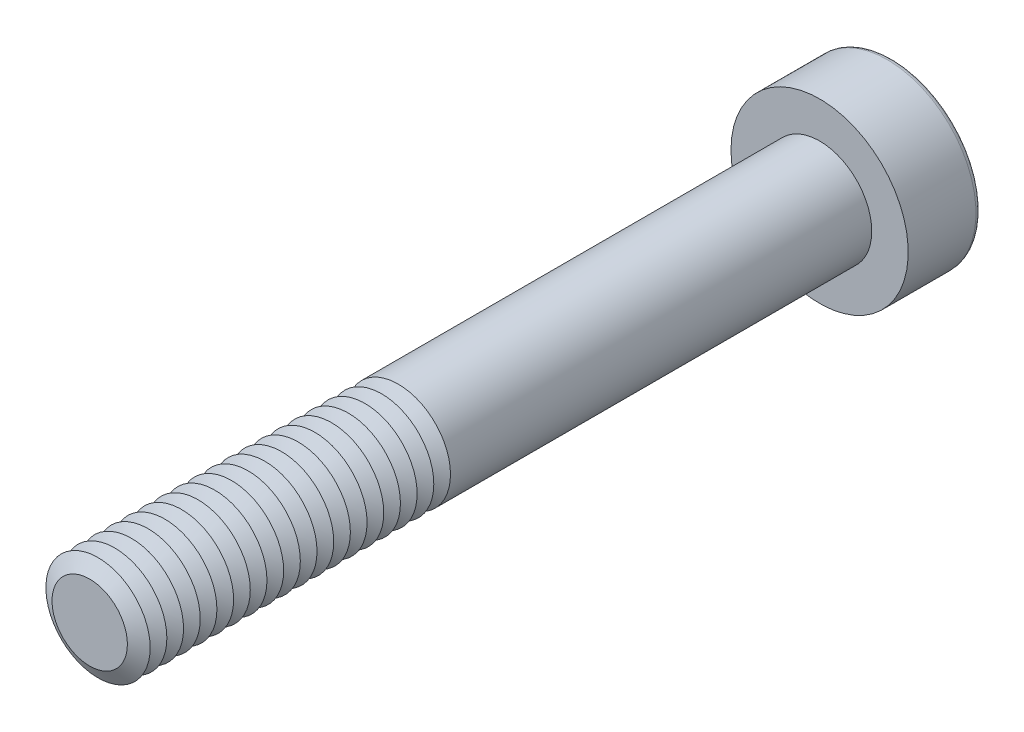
ISO-10303-21;
HEADER;
FILE_DESCRIPTION(('STEP AP214'),'2;1');
FILE_NAME('part.step','',(''),(''),'','','');
FILE_SCHEMA(('AUTOMOTIVE_DESIGN { 1 0 10303 214 1 1 1 1 }'));
ENDSEC;
DATA;
#1=APPLICATION_CONTEXT('core data for automotive mechanical design processes');
#2=APPLICATION_PROTOCOL_DEFINITION('international standard','automotive_design',2000,#1);
#3=PRODUCT_CONTEXT('',#1,'mechanical');
#4=PRODUCT('Part','Part','',(#3));
#5=PRODUCT_RELATED_PRODUCT_CATEGORY('part','',(#4));
#6=PRODUCT_DEFINITION_FORMATION('','',#4);
#7=PRODUCT_DEFINITION_CONTEXT('part definition',#1,'design');
#8=PRODUCT_DEFINITION('design','',#6,#7);
#9=PRODUCT_DEFINITION_SHAPE('','',#8);
#10=(LENGTH_UNIT() NAMED_UNIT(*) SI_UNIT(.MILLI.,.METRE.));
#11=(NAMED_UNIT(*) PLANE_ANGLE_UNIT() SI_UNIT($,.RADIAN.));
#12=(NAMED_UNIT(*) SI_UNIT($,.STERADIAN.) SOLID_ANGLE_UNIT());
#13=UNCERTAINTY_MEASURE_WITH_UNIT(LENGTH_MEASURE(1.E-05),#10,'distance_accuracy_value','');
#14=(GEOMETRIC_REPRESENTATION_CONTEXT(3) GLOBAL_UNCERTAINTY_ASSIGNED_CONTEXT((#13)) GLOBAL_UNIT_ASSIGNED_CONTEXT((#10,
#11,#12)) REPRESENTATION_CONTEXT('',''));
#15=CARTESIAN_POINT('',(0.,0.,0.));
#16=DIRECTION('',(0.,0.,1.));
#17=DIRECTION('',(1.,0.,0.));
#18=AXIS2_PLACEMENT_3D('',#15,#16,#17);
#19=CARTESIAN_POINT('',(0.,0.,32.2));
#20=DIRECTION('',(0.,0.,1.));
#21=DIRECTION('',(1.,0.,0.));
#22=AXIS2_PLACEMENT_3D('',#19,#20,#21);
#23=CONICAL_SURFACE('',#22,2.5,1.0471975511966);
#24=CARTESIAN_POINT('',(0.,0.,31.8));
#25=DIRECTION('',(0.,0.,1.));
#26=DIRECTION('',(1.,0.,0.));
#27=AXIS2_PLACEMENT_3D('',#24,#25,#26);
#28=CIRCLE('',#27,1.80717967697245);
#29=CARTESIAN_POINT('',(1.80717967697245,0.,31.8));
#30=VERTEX_POINT('',#29);
#31=EDGE_CURVE('E314',#30,#30,#28,.T.);
#32=ORIENTED_EDGE('',*,*,#31,.T.);
#33=EDGE_LOOP('',(#32));
#34=FACE_BOUND('',#33,.T.);
#35=CARTESIAN_POINT('',(0.,0.,32.2));
#36=DIRECTION('',(0.,0.,1.));
#37=DIRECTION('',(1.,0.,0.));
#38=AXIS2_PLACEMENT_3D('',#35,#36,#37);
#39=CIRCLE('',#38,2.5);
#40=CARTESIAN_POINT('',(2.5,0.,32.2));
#41=VERTEX_POINT('',#40);
#42=EDGE_CURVE('E317',#41,#41,#39,.T.);
#43=ORIENTED_EDGE('',*,*,#42,.F.);
#44=EDGE_LOOP('',(#43));
#45=FACE_BOUND('',#44,.T.);
#46=ADVANCED_FACE('F39',(#34,#45),#23,.T.);
#47=CARTESIAN_POINT('',(0.,0.,31.8));
#48=DIRECTION('',(0.,0.,-1.));
#49=DIRECTION('',(-1.,0.,0.));
#50=AXIS2_PLACEMENT_3D('',#47,#48,#49);
#51=CONICAL_SURFACE('',#50,1.80717967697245,1.04719755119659);
#52=CARTESIAN_POINT('',(0.,0.,31.4));
#53=DIRECTION('',(0.,0.,1.));
#54=DIRECTION('',(1.,0.,0.));
#55=AXIS2_PLACEMENT_3D('',#52,#53,#54);
#56=CIRCLE('',#55,2.5);
#57=CARTESIAN_POINT('',(2.5,0.,31.4));
#58=VERTEX_POINT('',#57);
#59=EDGE_CURVE('E324',#58,#58,#56,.T.);
#60=ORIENTED_EDGE('',*,*,#59,.T.);
#61=EDGE_LOOP('',(#60));
#62=FACE_BOUND('',#61,.T.);
#63=ORIENTED_EDGE('',*,*,#31,.F.);
#64=EDGE_LOOP('',(#63));
#65=FACE_BOUND('',#64,.T.);
#66=ADVANCED_FACE('F245',(#62,#65),#51,.T.);
#67=CARTESIAN_POINT('',(0.,0.,35.));
#68=DIRECTION('',(0.,0.,1.));
#69=DIRECTION('',(1.,0.,0.));
#70=AXIS2_PLACEMENT_3D('',#67,#68,#69);
#71=PLANE('',#70);
#72=CARTESIAN_POINT('',(0.,0.,35.));
#73=DIRECTION('',(0.,0.,1.));
#74=DIRECTION('',(1.,0.,0.));
#75=AXIS2_PLACEMENT_3D('',#72,#73,#74);
#76=CIRCLE('',#75,1.80717967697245);
#77=CARTESIAN_POINT('',(1.80717967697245,0.,35.));
#78=VERTEX_POINT('',#77);
#79=EDGE_CURVE('E174',#78,#78,#76,.T.);
#80=ORIENTED_EDGE('',*,*,#79,.T.);
#81=EDGE_LOOP('',(#80));
#82=FACE_BOUND('',#81,.T.);
#83=ADVANCED_FACE('F251',(#82),#71,.T.);
#84=CARTESIAN_POINT('',(0.,0.,35.));
#85=DIRECTION('',(0.,0.,-1.));
#86=DIRECTION('',(-1.,0.,0.));
#87=AXIS2_PLACEMENT_3D('',#84,#85,#86);
#88=CONICAL_SURFACE('',#87,1.80717967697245,1.04719755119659);
#89=CARTESIAN_POINT('',(0.,0.,34.6));
#90=DIRECTION('',(0.,0.,1.));
#91=DIRECTION('',(1.,0.,0.));
#92=AXIS2_PLACEMENT_3D('',#89,#90,#91);
#93=CIRCLE('',#92,2.5);
#94=CARTESIAN_POINT('',(2.5,0.,34.6));
#95=VERTEX_POINT('',#94);
#96=EDGE_CURVE('E291',#95,#95,#93,.T.);
#97=ORIENTED_EDGE('',*,*,#96,.T.);
#98=EDGE_LOOP('',(#97));
#99=FACE_BOUND('',#98,.T.);
#100=ORIENTED_EDGE('',*,*,#79,.F.);
#101=EDGE_LOOP('',(#100));
#102=FACE_BOUND('',#101,.T.);
#103=ADVANCED_FACE('F199',(#99,#102),#88,.T.);
#104=CARTESIAN_POINT('',(0.,0.,34.6));
#105=DIRECTION('',(0.,0.,1.));
#106=DIRECTION('',(1.,0.,0.));
#107=AXIS2_PLACEMENT_3D('',#104,#105,#106);
#108=CONICAL_SURFACE('',#107,2.5,1.0471975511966);
#109=CARTESIAN_POINT('',(0.,0.,34.2));
#110=DIRECTION('',(0.,0.,1.));
#111=DIRECTION('',(1.,0.,0.));
#112=AXIS2_PLACEMENT_3D('',#109,#110,#111);
#113=CIRCLE('',#112,1.80717967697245);
#114=CARTESIAN_POINT('',(1.80717967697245,0.,34.2));
#115=VERTEX_POINT('',#114);
#116=EDGE_CURVE('E288',#115,#115,#113,.T.);
#117=ORIENTED_EDGE('',*,*,#116,.T.);
#118=EDGE_LOOP('',(#117));
#119=FACE_BOUND('',#118,.T.);
#120=ORIENTED_EDGE('',*,*,#96,.F.);
#121=EDGE_LOOP('',(#120));
#122=FACE_BOUND('',#121,.T.);
#123=ADVANCED_FACE('F277',(#119,#122),#108,.T.);
#124=CARTESIAN_POINT('',(0.,0.,34.2));
#125=DIRECTION('',(0.,0.,-1.));
#126=DIRECTION('',(-1.,0.,0.));
#127=AXIS2_PLACEMENT_3D('',#124,#125,#126);
#128=CONICAL_SURFACE('',#127,1.80717967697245,1.04719755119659);
#129=CARTESIAN_POINT('',(0.,0.,33.8));
#130=DIRECTION('',(0.,0.,1.));
#131=DIRECTION('',(1.,0.,0.));
#132=AXIS2_PLACEMENT_3D('',#129,#130,#131);
#133=CIRCLE('',#132,2.5);
#134=CARTESIAN_POINT('',(2.5,0.,33.8));
#135=VERTEX_POINT('',#134);
#136=EDGE_CURVE('E300',#135,#135,#133,.T.);
#137=ORIENTED_EDGE('',*,*,#136,.T.);
#138=EDGE_LOOP('',(#137));
#139=FACE_BOUND('',#138,.T.);
#140=ORIENTED_EDGE('',*,*,#116,.F.);
#141=EDGE_LOOP('',(#140));
#142=FACE_BOUND('',#141,.T.);
#143=ADVANCED_FACE('F274',(#139,#142),#128,.T.);
#144=CARTESIAN_POINT('',(0.,0.,33.8));
#145=DIRECTION('',(0.,0.,1.));
#146=DIRECTION('',(1.,0.,0.));
#147=AXIS2_PLACEMENT_3D('',#144,#145,#146);
#148=CONICAL_SURFACE('',#147,2.5,1.0471975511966);
#149=CARTESIAN_POINT('',(0.,0.,33.4));
#150=DIRECTION('',(0.,0.,1.));
#151=DIRECTION('',(1.,0.,0.));
#152=AXIS2_PLACEMENT_3D('',#149,#150,#151);
#153=CIRCLE('',#152,1.80717967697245);
#154=CARTESIAN_POINT('',(1.80717967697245,0.,33.4));
#155=VERTEX_POINT('',#154);
#156=EDGE_CURVE('E293',#155,#155,#153,.T.);
#157=ORIENTED_EDGE('',*,*,#156,.T.);
#158=EDGE_LOOP('',(#157));
#159=FACE_BOUND('',#158,.T.);
#160=ORIENTED_EDGE('',*,*,#136,.F.);
#161=EDGE_LOOP('',(#160));
#162=FACE_BOUND('',#161,.T.);
#163=ADVANCED_FACE('F270',(#159,#162),#148,.T.);
#164=CARTESIAN_POINT('',(0.,0.,33.4));
#165=DIRECTION('',(0.,0.,-1.));
#166=DIRECTION('',(-1.,0.,0.));
#167=AXIS2_PLACEMENT_3D('',#164,#165,#166);
#168=CONICAL_SURFACE('',#167,1.80717967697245,1.04719755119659);
#169=CARTESIAN_POINT('',(0.,0.,33.));
#170=DIRECTION('',(0.,0.,1.));
#171=DIRECTION('',(1.,0.,0.));
#172=AXIS2_PLACEMENT_3D('',#169,#170,#171);
#173=CIRCLE('',#172,2.5);
#174=CARTESIAN_POINT('',(2.5,0.,33.));
#175=VERTEX_POINT('',#174);
#176=EDGE_CURVE('E310',#175,#175,#173,.T.);
#177=ORIENTED_EDGE('',*,*,#176,.T.);
#178=EDGE_LOOP('',(#177));
#179=FACE_BOUND('',#178,.T.);
#180=ORIENTED_EDGE('',*,*,#156,.F.);
#181=EDGE_LOOP('',(#180));
#182=FACE_BOUND('',#181,.T.);
#183=ADVANCED_FACE('F266',(#179,#182),#168,.T.);
#184=CARTESIAN_POINT('',(0.,0.,33.));
#185=DIRECTION('',(0.,0.,1.));
#186=DIRECTION('',(1.,0.,0.));
#187=AXIS2_PLACEMENT_3D('',#184,#185,#186);
#188=CONICAL_SURFACE('',#187,2.5,1.0471975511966);
#189=CARTESIAN_POINT('',(0.,0.,32.6));
#190=DIRECTION('',(0.,0.,1.));
#191=DIRECTION('',(1.,0.,0.));
#192=AXIS2_PLACEMENT_3D('',#189,#190,#191);
#193=CIRCLE('',#192,1.80717967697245);
#194=CARTESIAN_POINT('',(1.80717967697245,0.,32.6));
#195=VERTEX_POINT('',#194);
#196=EDGE_CURVE('E306',#195,#195,#193,.T.);
#197=ORIENTED_EDGE('',*,*,#196,.T.);
#198=EDGE_LOOP('',(#197));
#199=FACE_BOUND('',#198,.T.);
#200=ORIENTED_EDGE('',*,*,#176,.F.);
#201=EDGE_LOOP('',(#200));
#202=FACE_BOUND('',#201,.T.);
#203=ADVANCED_FACE('F262',(#199,#202),#188,.T.);
#204=CARTESIAN_POINT('',(0.,0.,32.6));
#205=DIRECTION('',(0.,0.,-1.));
#206=DIRECTION('',(-1.,0.,0.));
#207=AXIS2_PLACEMENT_3D('',#204,#205,#206);
#208=CONICAL_SURFACE('',#207,1.80717967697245,1.04719755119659);
#209=ORIENTED_EDGE('',*,*,#42,.T.);
#210=EDGE_LOOP('',(#209));
#211=FACE_BOUND('',#210,.T.);
#212=ORIENTED_EDGE('',*,*,#196,.F.);
#213=EDGE_LOOP('',(#212));
#214=FACE_BOUND('',#213,.T.);
#215=ADVANCED_FACE('F258',(#211,#214),#208,.T.);
#216=CARTESIAN_POINT('',(0.,0.,31.4));
#217=DIRECTION('',(0.,0.,1.));
#218=DIRECTION('',(1.,0.,0.));
#219=AXIS2_PLACEMENT_3D('',#216,#217,#218);
#220=CONICAL_SURFACE('',#219,2.5,1.0471975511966);
#221=CARTESIAN_POINT('',(0.,0.,31.));
#222=DIRECTION('',(0.,0.,1.));
#223=DIRECTION('',(1.,0.,0.));
#224=AXIS2_PLACEMENT_3D('',#221,#222,#223);
#225=CIRCLE('',#224,1.80717967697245);
#226=CARTESIAN_POINT('',(1.80717967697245,0.,31.));
#227=VERTEX_POINT('',#226);
#228=EDGE_CURVE('E320',#227,#227,#225,.T.);
#229=ORIENTED_EDGE('',*,*,#228,.T.);
#230=EDGE_LOOP('',(#229));
#231=FACE_BOUND('',#230,.T.);
#232=ORIENTED_EDGE('',*,*,#59,.F.);
#233=EDGE_LOOP('',(#232));
#234=FACE_BOUND('',#233,.T.);
#235=ADVANCED_FACE('F261',(#231,#234),#220,.T.);
#236=CARTESIAN_POINT('',(0.,0.,31.));
#237=DIRECTION('',(0.,0.,-1.));
#238=DIRECTION('',(-1.,0.,0.));
#239=AXIS2_PLACEMENT_3D('',#236,#237,#238);
#240=CONICAL_SURFACE('',#239,1.80717967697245,1.04719755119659);
#241=CARTESIAN_POINT('',(0.,0.,30.6));
#242=DIRECTION('',(0.,0.,1.));
#243=DIRECTION('',(1.,0.,0.));
#244=AXIS2_PLACEMENT_3D('',#241,#242,#243);
#245=CIRCLE('',#244,2.5);
#246=CARTESIAN_POINT('',(2.5,0.,30.6));
#247=VERTEX_POINT('',#246);
#248=EDGE_CURVE('E332',#247,#247,#245,.T.);
#249=ORIENTED_EDGE('',*,*,#248,.T.);
#250=EDGE_LOOP('',(#249));
#251=FACE_BOUND('',#250,.T.);
#252=ORIENTED_EDGE('',*,*,#228,.F.);
#253=EDGE_LOOP('',(#252));
#254=FACE_BOUND('',#253,.T.);
#255=ADVANCED_FACE('F544',(#251,#254),#240,.T.);
#256=CARTESIAN_POINT('',(0.,0.,30.6));
#257=DIRECTION('',(0.,0.,1.));
#258=DIRECTION('',(1.,0.,0.));
#259=AXIS2_PLACEMENT_3D('',#256,#257,#258);
#260=CONICAL_SURFACE('',#259,2.5,1.0471975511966);
#261=CARTESIAN_POINT('',(0.,0.,30.2));
#262=DIRECTION('',(0.,0.,1.));
#263=DIRECTION('',(1.,0.,0.));
#264=AXIS2_PLACEMENT_3D('',#261,#262,#263);
#265=CIRCLE('',#264,1.80717967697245);
#266=CARTESIAN_POINT('',(1.80717967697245,0.,30.2));
#267=VERTEX_POINT('',#266);
#268=EDGE_CURVE('E328',#267,#267,#265,.T.);
#269=ORIENTED_EDGE('',*,*,#268,.T.);
#270=EDGE_LOOP('',(#269));
#271=FACE_BOUND('',#270,.T.);
#272=ORIENTED_EDGE('',*,*,#248,.F.);
#273=EDGE_LOOP('',(#272));
#274=FACE_BOUND('',#273,.T.);
#275=ADVANCED_FACE('F540',(#271,#274),#260,.T.);
#276=CARTESIAN_POINT('',(0.,0.,30.2));
#277=DIRECTION('',(0.,0.,-1.));
#278=DIRECTION('',(-1.,0.,0.));
#279=AXIS2_PLACEMENT_3D('',#276,#277,#278);
#280=CONICAL_SURFACE('',#279,1.80717967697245,1.04719755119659);
#281=CARTESIAN_POINT('',(0.,0.,29.8));
#282=DIRECTION('',(0.,0.,1.));
#283=DIRECTION('',(1.,0.,0.));
#284=AXIS2_PLACEMENT_3D('',#281,#282,#283);
#285=CIRCLE('',#284,2.5);
#286=CARTESIAN_POINT('',(2.5,0.,29.8));
#287=VERTEX_POINT('',#286);
#288=EDGE_CURVE('E340',#287,#287,#285,.T.);
#289=ORIENTED_EDGE('',*,*,#288,.T.);
#290=EDGE_LOOP('',(#289));
#291=FACE_BOUND('',#290,.T.);
#292=ORIENTED_EDGE('',*,*,#268,.F.);
#293=EDGE_LOOP('',(#292));
#294=FACE_BOUND('',#293,.T.);
#295=ADVANCED_FACE('F536',(#291,#294),#280,.T.);
#296=CARTESIAN_POINT('',(0.,0.,29.8));
#297=DIRECTION('',(0.,0.,1.));
#298=DIRECTION('',(1.,0.,0.));
#299=AXIS2_PLACEMENT_3D('',#296,#297,#298);
#300=CONICAL_SURFACE('',#299,2.5,1.0471975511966);
#301=CARTESIAN_POINT('',(0.,0.,29.4));
#302=DIRECTION('',(0.,0.,1.));
#303=DIRECTION('',(1.,0.,0.));
#304=AXIS2_PLACEMENT_3D('',#301,#302,#303);
#305=CIRCLE('',#304,1.80717967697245);
#306=CARTESIAN_POINT('',(1.80717967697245,0.,29.4));
#307=VERTEX_POINT('',#306);
#308=EDGE_CURVE('E336',#307,#307,#305,.T.);
#309=ORIENTED_EDGE('',*,*,#308,.T.);
#310=EDGE_LOOP('',(#309));
#311=FACE_BOUND('',#310,.T.);
#312=ORIENTED_EDGE('',*,*,#288,.F.);
#313=EDGE_LOOP('',(#312));
#314=FACE_BOUND('',#313,.T.);
#315=ADVANCED_FACE('F532',(#311,#314),#300,.T.);
#316=CARTESIAN_POINT('',(0.,0.,29.4));
#317=DIRECTION('',(0.,0.,-1.));
#318=DIRECTION('',(-1.,0.,0.));
#319=AXIS2_PLACEMENT_3D('',#316,#317,#318);
#320=CONICAL_SURFACE('',#319,1.80717967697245,1.04719755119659);
#321=CARTESIAN_POINT('',(0.,0.,29.));
#322=DIRECTION('',(0.,0.,1.));
#323=DIRECTION('',(1.,0.,0.));
#324=AXIS2_PLACEMENT_3D('',#321,#322,#323);
#325=CIRCLE('',#324,2.5);
#326=CARTESIAN_POINT('',(2.5,0.,29.));
#327=VERTEX_POINT('',#326);
#328=EDGE_CURVE('E348',#327,#327,#325,.T.);
#329=ORIENTED_EDGE('',*,*,#328,.T.);
#330=EDGE_LOOP('',(#329));
#331=FACE_BOUND('',#330,.T.);
#332=ORIENTED_EDGE('',*,*,#308,.F.);
#333=EDGE_LOOP('',(#332));
#334=FACE_BOUND('',#333,.T.);
#335=ADVANCED_FACE('F528',(#331,#334),#320,.T.);
#336=CARTESIAN_POINT('',(0.,0.,29.));
#337=DIRECTION('',(0.,0.,1.));
#338=DIRECTION('',(1.,0.,0.));
#339=AXIS2_PLACEMENT_3D('',#336,#337,#338);
#340=CONICAL_SURFACE('',#339,2.5,1.0471975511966);
#341=CARTESIAN_POINT('',(0.,0.,28.6));
#342=DIRECTION('',(0.,0.,1.));
#343=DIRECTION('',(1.,0.,0.));
#344=AXIS2_PLACEMENT_3D('',#341,#342,#343);
#345=CIRCLE('',#344,1.80717967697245);
#346=CARTESIAN_POINT('',(1.80717967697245,0.,28.6));
#347=VERTEX_POINT('',#346);
#348=EDGE_CURVE('E344',#347,#347,#345,.T.);
#349=ORIENTED_EDGE('',*,*,#348,.T.);
#350=EDGE_LOOP('',(#349));
#351=FACE_BOUND('',#350,.T.);
#352=ORIENTED_EDGE('',*,*,#328,.F.);
#353=EDGE_LOOP('',(#352));
#354=FACE_BOUND('',#353,.T.);
#355=ADVANCED_FACE('F524',(#351,#354),#340,.T.);
#356=CARTESIAN_POINT('',(0.,0.,28.6));
#357=DIRECTION('',(0.,0.,-1.));
#358=DIRECTION('',(-1.,0.,0.));
#359=AXIS2_PLACEMENT_3D('',#356,#357,#358);
#360=CONICAL_SURFACE('',#359,1.80717967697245,1.04719755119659);
#361=CARTESIAN_POINT('',(0.,0.,28.2));
#362=DIRECTION('',(0.,0.,1.));
#363=DIRECTION('',(1.,0.,0.));
#364=AXIS2_PLACEMENT_3D('',#361,#362,#363);
#365=CIRCLE('',#364,2.5);
#366=CARTESIAN_POINT('',(2.5,0.,28.2));
#367=VERTEX_POINT('',#366);
#368=EDGE_CURVE('E356',#367,#367,#365,.T.);
#369=ORIENTED_EDGE('',*,*,#368,.T.);
#370=EDGE_LOOP('',(#369));
#371=FACE_BOUND('',#370,.T.);
#372=ORIENTED_EDGE('',*,*,#348,.F.);
#373=EDGE_LOOP('',(#372));
#374=FACE_BOUND('',#373,.T.);
#375=ADVANCED_FACE('F520',(#371,#374),#360,.T.);
#376=CARTESIAN_POINT('',(0.,0.,28.2));
#377=DIRECTION('',(0.,0.,1.));
#378=DIRECTION('',(1.,0.,0.));
#379=AXIS2_PLACEMENT_3D('',#376,#377,#378);
#380=CONICAL_SURFACE('',#379,2.5,1.0471975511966);
#381=CARTESIAN_POINT('',(0.,0.,27.8));
#382=DIRECTION('',(0.,0.,1.));
#383=DIRECTION('',(1.,0.,0.));
#384=AXIS2_PLACEMENT_3D('',#381,#382,#383);
#385=CIRCLE('',#384,1.80717967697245);
#386=CARTESIAN_POINT('',(1.80717967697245,0.,27.8));
#387=VERTEX_POINT('',#386);
#388=EDGE_CURVE('E352',#387,#387,#385,.T.);
#389=ORIENTED_EDGE('',*,*,#388,.T.);
#390=EDGE_LOOP('',(#389));
#391=FACE_BOUND('',#390,.T.);
#392=ORIENTED_EDGE('',*,*,#368,.F.);
#393=EDGE_LOOP('',(#392));
#394=FACE_BOUND('',#393,.T.);
#395=ADVANCED_FACE('F516',(#391,#394),#380,.T.);
#396=CARTESIAN_POINT('',(0.,0.,27.8));
#397=DIRECTION('',(0.,0.,-1.));
#398=DIRECTION('',(-1.,0.,0.));
#399=AXIS2_PLACEMENT_3D('',#396,#397,#398);
#400=CONICAL_SURFACE('',#399,1.80717967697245,1.04719755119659);
#401=CARTESIAN_POINT('',(0.,0.,27.4));
#402=DIRECTION('',(0.,0.,1.));
#403=DIRECTION('',(1.,0.,0.));
#404=AXIS2_PLACEMENT_3D('',#401,#402,#403);
#405=CIRCLE('',#404,2.5);
#406=CARTESIAN_POINT('',(2.5,0.,27.4));
#407=VERTEX_POINT('',#406);
#408=EDGE_CURVE('E364',#407,#407,#405,.T.);
#409=ORIENTED_EDGE('',*,*,#408,.T.);
#410=EDGE_LOOP('',(#409));
#411=FACE_BOUND('',#410,.T.);
#412=ORIENTED_EDGE('',*,*,#388,.F.);
#413=EDGE_LOOP('',(#412));
#414=FACE_BOUND('',#413,.T.);
#415=ADVANCED_FACE('F512',(#411,#414),#400,.T.);
#416=CARTESIAN_POINT('',(0.,0.,27.4));
#417=DIRECTION('',(0.,0.,1.));
#418=DIRECTION('',(1.,0.,0.));
#419=AXIS2_PLACEMENT_3D('',#416,#417,#418);
#420=CONICAL_SURFACE('',#419,2.5,1.0471975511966);
#421=CARTESIAN_POINT('',(0.,0.,27.));
#422=DIRECTION('',(0.,0.,1.));
#423=DIRECTION('',(1.,0.,0.));
#424=AXIS2_PLACEMENT_3D('',#421,#422,#423);
#425=CIRCLE('',#424,1.80717967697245);
#426=CARTESIAN_POINT('',(1.80717967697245,0.,27.));
#427=VERTEX_POINT('',#426);
#428=EDGE_CURVE('E360',#427,#427,#425,.T.);
#429=ORIENTED_EDGE('',*,*,#428,.T.);
#430=EDGE_LOOP('',(#429));
#431=FACE_BOUND('',#430,.T.);
#432=ORIENTED_EDGE('',*,*,#408,.F.);
#433=EDGE_LOOP('',(#432));
#434=FACE_BOUND('',#433,.T.);
#435=ADVANCED_FACE('F508',(#431,#434),#420,.T.);
#436=CARTESIAN_POINT('',(0.,0.,27.));
#437=DIRECTION('',(0.,0.,-1.));
#438=DIRECTION('',(-1.,0.,0.));
#439=AXIS2_PLACEMENT_3D('',#436,#437,#438);
#440=CONICAL_SURFACE('',#439,1.80717967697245,1.04719755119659);
#441=CARTESIAN_POINT('',(0.,0.,26.6));
#442=DIRECTION('',(0.,0.,1.));
#443=DIRECTION('',(1.,0.,0.));
#444=AXIS2_PLACEMENT_3D('',#441,#442,#443);
#445=CIRCLE('',#444,2.5);
#446=CARTESIAN_POINT('',(2.5,0.,26.6));
#447=VERTEX_POINT('',#446);
#448=EDGE_CURVE('E371',#447,#447,#445,.T.);
#449=ORIENTED_EDGE('',*,*,#448,.T.);
#450=EDGE_LOOP('',(#449));
#451=FACE_BOUND('',#450,.T.);
#452=ORIENTED_EDGE('',*,*,#428,.F.);
#453=EDGE_LOOP('',(#452));
#454=FACE_BOUND('',#453,.T.);
#455=ADVANCED_FACE('F504',(#451,#454),#440,.T.);
#456=CARTESIAN_POINT('',(0.,0.,26.6));
#457=DIRECTION('',(0.,0.,1.));
#458=DIRECTION('',(1.,0.,0.));
#459=AXIS2_PLACEMENT_3D('',#456,#457,#458);
#460=CONICAL_SURFACE('',#459,2.5,1.0471975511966);
#461=CARTESIAN_POINT('',(0.,0.,26.2));
#462=DIRECTION('',(0.,0.,1.));
#463=DIRECTION('',(1.,0.,0.));
#464=AXIS2_PLACEMENT_3D('',#461,#462,#463);
#465=CIRCLE('',#464,1.80717967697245);
#466=CARTESIAN_POINT('',(1.80717967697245,0.,26.2));
#467=VERTEX_POINT('',#466);
#468=EDGE_CURVE('E367',#467,#467,#465,.T.);
#469=ORIENTED_EDGE('',*,*,#468,.T.);
#470=EDGE_LOOP('',(#469));
#471=FACE_BOUND('',#470,.T.);
#472=ORIENTED_EDGE('',*,*,#448,.F.);
#473=EDGE_LOOP('',(#472));
#474=FACE_BOUND('',#473,.T.);
#475=ADVANCED_FACE('F500',(#471,#474),#460,.T.);
#476=CARTESIAN_POINT('',(0.,0.,26.2));
#477=DIRECTION('',(0.,0.,-1.));
#478=DIRECTION('',(-1.,0.,0.));
#479=AXIS2_PLACEMENT_3D('',#476,#477,#478);
#480=CONICAL_SURFACE('',#479,1.80717967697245,1.04719755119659);
#481=CARTESIAN_POINT('',(0.,0.,25.8));
#482=DIRECTION('',(0.,0.,1.));
#483=DIRECTION('',(1.,0.,0.));
#484=AXIS2_PLACEMENT_3D('',#481,#482,#483);
#485=CIRCLE('',#484,2.5);
#486=CARTESIAN_POINT('',(2.5,0.,25.8));
#487=VERTEX_POINT('',#486);
#488=EDGE_CURVE('E379',#487,#487,#485,.T.);
#489=ORIENTED_EDGE('',*,*,#488,.T.);
#490=EDGE_LOOP('',(#489));
#491=FACE_BOUND('',#490,.T.);
#492=ORIENTED_EDGE('',*,*,#468,.F.);
#493=EDGE_LOOP('',(#492));
#494=FACE_BOUND('',#493,.T.);
#495=ADVANCED_FACE('F496',(#491,#494),#480,.T.);
#496=CARTESIAN_POINT('',(0.,0.,25.8));
#497=DIRECTION('',(0.,0.,1.));
#498=DIRECTION('',(1.,0.,0.));
#499=AXIS2_PLACEMENT_3D('',#496,#497,#498);
#500=CONICAL_SURFACE('',#499,2.5,1.0471975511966);
#501=CARTESIAN_POINT('',(0.,0.,25.4));
#502=DIRECTION('',(0.,0.,1.));
#503=DIRECTION('',(1.,0.,0.));
#504=AXIS2_PLACEMENT_3D('',#501,#502,#503);
#505=CIRCLE('',#504,1.80717967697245);
#506=CARTESIAN_POINT('',(1.80717967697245,0.,25.4));
#507=VERTEX_POINT('',#506);
#508=EDGE_CURVE('E375',#507,#507,#505,.T.);
#509=ORIENTED_EDGE('',*,*,#508,.T.);
#510=EDGE_LOOP('',(#509));
#511=FACE_BOUND('',#510,.T.);
#512=ORIENTED_EDGE('',*,*,#488,.F.);
#513=EDGE_LOOP('',(#512));
#514=FACE_BOUND('',#513,.T.);
#515=ADVANCED_FACE('F492',(#511,#514),#500,.T.);
#516=CARTESIAN_POINT('',(0.,0.,25.4));
#517=DIRECTION('',(0.,0.,-1.));
#518=DIRECTION('',(-1.,0.,0.));
#519=AXIS2_PLACEMENT_3D('',#516,#517,#518);
#520=CONICAL_SURFACE('',#519,1.80717967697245,1.04719755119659);
#521=CARTESIAN_POINT('',(0.,0.,25.));
#522=DIRECTION('',(0.,0.,1.));
#523=DIRECTION('',(1.,0.,0.));
#524=AXIS2_PLACEMENT_3D('',#521,#522,#523);
#525=CIRCLE('',#524,2.5);
#526=CARTESIAN_POINT('',(2.5,0.,25.));
#527=VERTEX_POINT('',#526);
#528=EDGE_CURVE('E387',#527,#527,#525,.T.);
#529=ORIENTED_EDGE('',*,*,#528,.T.);
#530=EDGE_LOOP('',(#529));
#531=FACE_BOUND('',#530,.T.);
#532=ORIENTED_EDGE('',*,*,#508,.F.);
#533=EDGE_LOOP('',(#532));
#534=FACE_BOUND('',#533,.T.);
#535=ADVANCED_FACE('F488',(#531,#534),#520,.T.);
#536=CARTESIAN_POINT('',(0.,0.,25.));
#537=DIRECTION('',(0.,0.,1.));
#538=DIRECTION('',(1.,0.,0.));
#539=AXIS2_PLACEMENT_3D('',#536,#537,#538);
#540=CONICAL_SURFACE('',#539,2.5,1.0471975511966);
#541=CARTESIAN_POINT('',(0.,0.,24.6));
#542=DIRECTION('',(0.,0.,1.));
#543=DIRECTION('',(1.,0.,0.));
#544=AXIS2_PLACEMENT_3D('',#541,#542,#543);
#545=CIRCLE('',#544,1.80717967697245);
#546=CARTESIAN_POINT('',(1.80717967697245,0.,24.6));
#547=VERTEX_POINT('',#546);
#548=EDGE_CURVE('E383',#547,#547,#545,.T.);
#549=ORIENTED_EDGE('',*,*,#548,.T.);
#550=EDGE_LOOP('',(#549));
#551=FACE_BOUND('',#550,.T.);
#552=ORIENTED_EDGE('',*,*,#528,.F.);
#553=EDGE_LOOP('',(#552));
#554=FACE_BOUND('',#553,.T.);
#555=ADVANCED_FACE('F484',(#551,#554),#540,.T.);
#556=CARTESIAN_POINT('',(0.,0.,24.6));
#557=DIRECTION('',(0.,0.,-1.));
#558=DIRECTION('',(-1.,0.,0.));
#559=AXIS2_PLACEMENT_3D('',#556,#557,#558);
#560=CONICAL_SURFACE('',#559,1.80717967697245,1.04719755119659);
#561=CARTESIAN_POINT('',(0.,0.,24.2));
#562=DIRECTION('',(0.,0.,1.));
#563=DIRECTION('',(1.,0.,0.));
#564=AXIS2_PLACEMENT_3D('',#561,#562,#563);
#565=CIRCLE('',#564,2.5);
#566=CARTESIAN_POINT('',(2.5,0.,24.2));
#567=VERTEX_POINT('',#566);
#568=EDGE_CURVE('E395',#567,#567,#565,.T.);
#569=ORIENTED_EDGE('',*,*,#568,.T.);
#570=EDGE_LOOP('',(#569));
#571=FACE_BOUND('',#570,.T.);
#572=ORIENTED_EDGE('',*,*,#548,.F.);
#573=EDGE_LOOP('',(#572));
#574=FACE_BOUND('',#573,.T.);
#575=ADVANCED_FACE('F480',(#571,#574),#560,.T.);
#576=CARTESIAN_POINT('',(0.,0.,24.2));
#577=DIRECTION('',(0.,0.,1.));
#578=DIRECTION('',(1.,0.,0.));
#579=AXIS2_PLACEMENT_3D('',#576,#577,#578);
#580=CONICAL_SURFACE('',#579,2.5,1.0471975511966);
#581=CARTESIAN_POINT('',(0.,0.,23.8));
#582=DIRECTION('',(0.,0.,1.));
#583=DIRECTION('',(1.,0.,0.));
#584=AXIS2_PLACEMENT_3D('',#581,#582,#583);
#585=CIRCLE('',#584,1.80717967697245);
#586=CARTESIAN_POINT('',(1.80717967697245,0.,23.8));
#587=VERTEX_POINT('',#586);
#588=EDGE_CURVE('E391',#587,#587,#585,.T.);
#589=ORIENTED_EDGE('',*,*,#588,.T.);
#590=EDGE_LOOP('',(#589));
#591=FACE_BOUND('',#590,.T.);
#592=ORIENTED_EDGE('',*,*,#568,.F.);
#593=EDGE_LOOP('',(#592));
#594=FACE_BOUND('',#593,.T.);
#595=ADVANCED_FACE('F476',(#591,#594),#580,.T.);
#596=CARTESIAN_POINT('',(0.,0.,23.8));
#597=DIRECTION('',(0.,0.,-1.));
#598=DIRECTION('',(-1.,0.,0.));
#599=AXIS2_PLACEMENT_3D('',#596,#597,#598);
#600=CONICAL_SURFACE('',#599,1.80717967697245,1.04719755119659);
#601=CARTESIAN_POINT('',(0.,0.,23.4));
#602=DIRECTION('',(0.,0.,1.));
#603=DIRECTION('',(1.,0.,0.));
#604=AXIS2_PLACEMENT_3D('',#601,#602,#603);
#605=CIRCLE('',#604,2.5);
#606=CARTESIAN_POINT('',(2.5,0.,23.4));
#607=VERTEX_POINT('',#606);
#608=EDGE_CURVE('E403',#607,#607,#605,.T.);
#609=ORIENTED_EDGE('',*,*,#608,.T.);
#610=EDGE_LOOP('',(#609));
#611=FACE_BOUND('',#610,.T.);
#612=ORIENTED_EDGE('',*,*,#588,.F.);
#613=EDGE_LOOP('',(#612));
#614=FACE_BOUND('',#613,.T.);
#615=ADVANCED_FACE('F472',(#611,#614),#600,.T.);
#616=CARTESIAN_POINT('',(0.,0.,23.4));
#617=DIRECTION('',(0.,0.,1.));
#618=DIRECTION('',(1.,0.,0.));
#619=AXIS2_PLACEMENT_3D('',#616,#617,#618);
#620=CONICAL_SURFACE('',#619,2.5,1.0471975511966);
#621=CARTESIAN_POINT('',(0.,0.,23.));
#622=DIRECTION('',(0.,0.,1.));
#623=DIRECTION('',(1.,0.,0.));
#624=AXIS2_PLACEMENT_3D('',#621,#622,#623);
#625=CIRCLE('',#624,1.80717967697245);
#626=CARTESIAN_POINT('',(1.80717967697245,0.,23.));
#627=VERTEX_POINT('',#626);
#628=EDGE_CURVE('E399',#627,#627,#625,.T.);
#629=ORIENTED_EDGE('',*,*,#628,.T.);
#630=EDGE_LOOP('',(#629));
#631=FACE_BOUND('',#630,.T.);
#632=ORIENTED_EDGE('',*,*,#608,.F.);
#633=EDGE_LOOP('',(#632));
#634=FACE_BOUND('',#633,.T.);
#635=ADVANCED_FACE('F468',(#631,#634),#620,.T.);
#636=CARTESIAN_POINT('',(0.,0.,23.));
#637=DIRECTION('',(0.,0.,-1.));
#638=DIRECTION('',(-1.,0.,0.));
#639=AXIS2_PLACEMENT_3D('',#636,#637,#638);
#640=CONICAL_SURFACE('',#639,1.80717967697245,1.04719755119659);
#641=CARTESIAN_POINT('',(0.,0.,22.6));
#642=DIRECTION('',(0.,0.,1.));
#643=DIRECTION('',(1.,0.,0.));
#644=AXIS2_PLACEMENT_3D('',#641,#642,#643);
#645=CIRCLE('',#644,2.5);
#646=CARTESIAN_POINT('',(2.5,0.,22.6));
#647=VERTEX_POINT('',#646);
#648=EDGE_CURVE('E411',#647,#647,#645,.T.);
#649=ORIENTED_EDGE('',*,*,#648,.T.);
#650=EDGE_LOOP('',(#649));
#651=FACE_BOUND('',#650,.T.);
#652=ORIENTED_EDGE('',*,*,#628,.F.);
#653=EDGE_LOOP('',(#652));
#654=FACE_BOUND('',#653,.T.);
#655=ADVANCED_FACE('F464',(#651,#654),#640,.T.);
#656=CARTESIAN_POINT('',(0.,0.,22.6));
#657=DIRECTION('',(0.,0.,1.));
#658=DIRECTION('',(1.,0.,0.));
#659=AXIS2_PLACEMENT_3D('',#656,#657,#658);
#660=CONICAL_SURFACE('',#659,2.5,1.0471975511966);
#661=CARTESIAN_POINT('',(0.,0.,22.2));
#662=DIRECTION('',(0.,0.,1.));
#663=DIRECTION('',(1.,0.,0.));
#664=AXIS2_PLACEMENT_3D('',#661,#662,#663);
#665=CIRCLE('',#664,1.80717967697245);
#666=CARTESIAN_POINT('',(1.80717967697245,0.,22.2));
#667=VERTEX_POINT('',#666);
#668=EDGE_CURVE('E407',#667,#667,#665,.T.);
#669=ORIENTED_EDGE('',*,*,#668,.T.);
#670=EDGE_LOOP('',(#669));
#671=FACE_BOUND('',#670,.T.);
#672=ORIENTED_EDGE('',*,*,#648,.F.);
#673=EDGE_LOOP('',(#672));
#674=FACE_BOUND('',#673,.T.);
#675=ADVANCED_FACE('F460',(#671,#674),#660,.T.);
#676=CARTESIAN_POINT('',(0.,0.,22.2));
#677=DIRECTION('',(0.,0.,-1.));
#678=DIRECTION('',(-1.,0.,0.));
#679=AXIS2_PLACEMENT_3D('',#676,#677,#678);
#680=CONICAL_SURFACE('',#679,1.80717967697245,1.04719755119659);
#681=CARTESIAN_POINT('',(0.,0.,21.8));
#682=DIRECTION('',(0.,0.,1.));
#683=DIRECTION('',(1.,0.,0.));
#684=AXIS2_PLACEMENT_3D('',#681,#682,#683);
#685=CIRCLE('',#684,2.5);
#686=CARTESIAN_POINT('',(2.5,0.,21.8));
#687=VERTEX_POINT('',#686);
#688=EDGE_CURVE('E419',#687,#687,#685,.T.);
#689=ORIENTED_EDGE('',*,*,#688,.T.);
#690=EDGE_LOOP('',(#689));
#691=FACE_BOUND('',#690,.T.);
#692=ORIENTED_EDGE('',*,*,#668,.F.);
#693=EDGE_LOOP('',(#692));
#694=FACE_BOUND('',#693,.T.);
#695=ADVANCED_FACE('F456',(#691,#694),#680,.T.);
#696=CARTESIAN_POINT('',(0.,0.,21.8));
#697=DIRECTION('',(0.,0.,1.));
#698=DIRECTION('',(1.,0.,0.));
#699=AXIS2_PLACEMENT_3D('',#696,#697,#698);
#700=CONICAL_SURFACE('',#699,2.5,1.0471975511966);
#701=CARTESIAN_POINT('',(0.,0.,21.4));
#702=DIRECTION('',(0.,0.,1.));
#703=DIRECTION('',(1.,0.,0.));
#704=AXIS2_PLACEMENT_3D('',#701,#702,#703);
#705=CIRCLE('',#704,1.80717967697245);
#706=CARTESIAN_POINT('',(1.80717967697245,0.,21.4));
#707=VERTEX_POINT('',#706);
#708=EDGE_CURVE('E415',#707,#707,#705,.T.);
#709=ORIENTED_EDGE('',*,*,#708,.T.);
#710=EDGE_LOOP('',(#709));
#711=FACE_BOUND('',#710,.T.);
#712=ORIENTED_EDGE('',*,*,#688,.F.);
#713=EDGE_LOOP('',(#712));
#714=FACE_BOUND('',#713,.T.);
#715=ADVANCED_FACE('F451',(#711,#714),#700,.T.);
#716=CARTESIAN_POINT('',(0.,0.,21.4));
#717=DIRECTION('',(0.,0.,-1.));
#718=DIRECTION('',(-1.,0.,0.));
#719=AXIS2_PLACEMENT_3D('',#716,#717,#718);
#720=CONICAL_SURFACE('',#719,1.80717967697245,1.04719755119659);
#721=CARTESIAN_POINT('',(0.,0.,21.));
#722=DIRECTION('',(0.,0.,1.));
#723=DIRECTION('',(1.,0.,0.));
#724=AXIS2_PLACEMENT_3D('',#721,#722,#723);
#725=CIRCLE('',#724,2.5);
#726=CARTESIAN_POINT('',(2.5,0.,21.));
#727=VERTEX_POINT('',#726);
#728=EDGE_CURVE('E431',#727,#727,#725,.T.);
#729=ORIENTED_EDGE('',*,*,#728,.T.);
#730=EDGE_LOOP('',(#729));
#731=FACE_BOUND('',#730,.T.);
#732=ORIENTED_EDGE('',*,*,#708,.F.);
#733=EDGE_LOOP('',(#732));
#734=FACE_BOUND('',#733,.T.);
#735=ADVANCED_FACE('F437',(#731,#734),#720,.T.);
#736=CARTESIAN_POINT('',(0.,0.,21.));
#737=DIRECTION('',(0.,0.,1.));
#738=DIRECTION('',(1.,0.,0.));
#739=AXIS2_PLACEMENT_3D('',#736,#737,#738);
#740=CONICAL_SURFACE('',#739,2.5,1.0471975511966);
#741=CARTESIAN_POINT('',(0.,0.,20.6));
#742=DIRECTION('',(0.,0.,1.));
#743=DIRECTION('',(1.,0.,0.));
#744=AXIS2_PLACEMENT_3D('',#741,#742,#743);
#745=CIRCLE('',#744,1.80717967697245);
#746=CARTESIAN_POINT('',(1.80717967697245,0.,20.6));
#747=VERTEX_POINT('',#746);
#748=EDGE_CURVE('E423',#747,#747,#745,.T.);
#749=ORIENTED_EDGE('',*,*,#748,.T.);
#750=EDGE_LOOP('',(#749));
#751=FACE_BOUND('',#750,.T.);
#752=ORIENTED_EDGE('',*,*,#728,.F.);
#753=EDGE_LOOP('',(#752));
#754=FACE_BOUND('',#753,.T.);
#755=ADVANCED_FACE('F440',(#751,#754),#740,.T.);
#756=CARTESIAN_POINT('',(0.,0.,20.6));
#757=DIRECTION('',(0.,0.,-1.));
#758=DIRECTION('',(-1.,0.,0.));
#759=AXIS2_PLACEMENT_3D('',#756,#757,#758);
#760=CONICAL_SURFACE('',#759,1.80717967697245,1.04719755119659);
#761=CARTESIAN_POINT('',(0.,0.,20.2));
#762=DIRECTION('',(0.,0.,1.));
#763=DIRECTION('',(1.,0.,0.));
#764=AXIS2_PLACEMENT_3D('',#761,#762,#763);
#765=CIRCLE('',#764,2.5);
#766=CARTESIAN_POINT('',(2.5,0.,20.2));
#767=VERTEX_POINT('',#766);
#768=EDGE_CURVE('E427',#767,#767,#765,.T.);
#769=ORIENTED_EDGE('',*,*,#768,.T.);
#770=EDGE_LOOP('',(#769));
#771=FACE_BOUND('',#770,.T.);
#772=ORIENTED_EDGE('',*,*,#748,.F.);
#773=EDGE_LOOP('',(#772));
#774=FACE_BOUND('',#773,.T.);
#775=ADVANCED_FACE('F442',(#771,#774),#760,.T.);
#776=CARTESIAN_POINT('',(0.,0.,-1.25));
#777=DIRECTION('',(0.,0.,-1.));
#778=DIRECTION('',(-1.,0.,0.));
#779=AXIS2_PLACEMENT_3D('',#776,#777,#778);
#780=CONICAL_SURFACE('',#779,1.5,1.0471975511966);
#781=CARTESIAN_POINT('',(0.,0.,-0.383974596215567));
#782=VERTEX_POINT('',#781);
#783=VERTEX_LOOP('',#782);
#784=FACE_BOUND('',#783,.T.);
#785=CARTESIAN_POINT('',(0.,0.,-1.25));
#786=DIRECTION('',(0.,0.,-1.));
#787=DIRECTION('',(-1.,0.,0.));
#788=AXIS2_PLACEMENT_3D('',#785,#786,#787);
#789=CIRCLE('',#788,1.5);
#790=CARTESIAN_POINT('',(-1.29903810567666,0.749999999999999,-1.25));
#791=VERTEX_POINT('',#790);
#792=CARTESIAN_POINT('',(0.,1.5,-1.25));
#793=VERTEX_POINT('',#792);
#794=EDGE_CURVE('E149',#791,#793,#789,.T.);
#795=ORIENTED_EDGE('',*,*,#794,.T.);
#796=CARTESIAN_POINT('',(0.,0.,-1.25));
#797=DIRECTION('',(0.,0.,-1.));
#798=DIRECTION('',(-1.,0.,0.));
#799=AXIS2_PLACEMENT_3D('',#796,#797,#798);
#800=CIRCLE('',#799,1.5);
#801=CARTESIAN_POINT('',(1.29903810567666,0.75,-1.25));
#802=VERTEX_POINT('',#801);
#803=EDGE_CURVE('E54',#793,#802,#800,.T.);
#804=ORIENTED_EDGE('',*,*,#803,.T.);
#805=CARTESIAN_POINT('',(1.29903810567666,-0.75,-1.25));
#806=VERTEX_POINT('',#805);
#807=EDGE_CURVE('E1087',#802,#806,#800,.T.);
#808=ORIENTED_EDGE('',*,*,#807,.T.);
#809=CARTESIAN_POINT('',(0.,-1.5,-1.25));
#810=VERTEX_POINT('',#809);
#811=EDGE_CURVE('E1085',#806,#810,#800,.T.);
#812=ORIENTED_EDGE('',*,*,#811,.T.);
#813=CARTESIAN_POINT('',(-1.29903810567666,-0.749999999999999,-1.25));
#814=VERTEX_POINT('',#813);
#815=EDGE_CURVE('E1079',#810,#814,#800,.T.);
#816=ORIENTED_EDGE('',*,*,#815,.T.);
#817=EDGE_CURVE('E1077',#814,#791,#800,.T.);
#818=ORIENTED_EDGE('',*,*,#817,.T.);
#819=EDGE_LOOP('',(#795,#804,#808,#812,#816,#818));
#820=FACE_BOUND('',#819,.T.);
#821=ADVANCED_FACE('F201',(#784,#820),#780,.F.);
#822=CARTESIAN_POINT('',(0.,0.,-1.25));
#823=DIRECTION('',(0.,0.,-1.));
#824=DIRECTION('',(-1.,0.,0.));
#825=AXIS2_PLACEMENT_3D('',#822,#823,#824);
#826=PLANE('',#825);
#827=ORIENTED_EDGE('',*,*,#803,.F.);
#828=DIRECTION('',(1.,0.,0.));
#829=VECTOR('',#828,1.);
#830=CARTESIAN_POINT('',(-0.866025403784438,1.5,-1.25));
#831=LINE('',#830,#829);
#832=CARTESIAN_POINT('',(0.86602540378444,1.5,-1.25));
#833=VERTEX_POINT('',#832);
#834=EDGE_CURVE('E1132',#793,#833,#831,.T.);
#835=ORIENTED_EDGE('',*,*,#834,.T.);
#836=DIRECTION('',(0.5,-0.866025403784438,0.));
#837=VECTOR('',#836,1.);
#838=CARTESIAN_POINT('',(0.86602540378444,1.5,-1.25));
#839=LINE('',#838,#837);
#840=EDGE_CURVE('E155',#833,#802,#839,.T.);
#841=ORIENTED_EDGE('',*,*,#840,.T.);
#842=EDGE_LOOP('',(#827,#835,#841));
#843=FACE_BOUND('',#842,.T.);
#844=ADVANCED_FACE('F651',(#843),#826,.T.);
#845=ORIENTED_EDGE('',*,*,#807,.F.);
#846=CARTESIAN_POINT('',(1.73205080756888,0.,-1.25));
#847=VERTEX_POINT('',#846);
#848=EDGE_CURVE('E1128',#802,#847,#839,.T.);
#849=ORIENTED_EDGE('',*,*,#848,.T.);
#850=DIRECTION('',(-0.5,-0.866025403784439,0.));
#851=VECTOR('',#850,1.);
#852=CARTESIAN_POINT('',(1.73205080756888,0.,-1.25));
#853=LINE('',#852,#851);
#854=EDGE_CURVE('E1099',#847,#806,#853,.T.);
#855=ORIENTED_EDGE('',*,*,#854,.T.);
#856=EDGE_LOOP('',(#845,#849,#855));
#857=FACE_BOUND('',#856,.T.);
#858=ADVANCED_FACE('F661',(#857),#826,.T.);
#859=ORIENTED_EDGE('',*,*,#811,.F.);
#860=CARTESIAN_POINT('',(0.86602540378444,-1.5,-1.25));
#861=VERTEX_POINT('',#860);
#862=EDGE_CURVE('E1101',#806,#861,#853,.T.);
#863=ORIENTED_EDGE('',*,*,#862,.T.);
#864=DIRECTION('',(-1.,0.,0.));
#865=VECTOR('',#864,1.);
#866=CARTESIAN_POINT('',(0.86602540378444,-1.5,-1.25));
#867=LINE('',#866,#865);
#868=EDGE_CURVE('E1052',#861,#810,#867,.T.);
#869=ORIENTED_EDGE('',*,*,#868,.T.);
#870=EDGE_LOOP('',(#859,#863,#869));
#871=FACE_BOUND('',#870,.T.);
#872=ADVANCED_FACE('F671',(#871),#826,.T.);
#873=ORIENTED_EDGE('',*,*,#815,.F.);
#874=CARTESIAN_POINT('',(-0.866025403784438,-1.5,-1.25));
#875=VERTEX_POINT('',#874);
#876=EDGE_CURVE('E1096',#810,#875,#867,.T.);
#877=ORIENTED_EDGE('',*,*,#876,.T.);
#878=DIRECTION('',(-0.5,0.866025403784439,0.));
#879=VECTOR('',#878,1.);
#880=CARTESIAN_POINT('',(-0.866025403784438,-1.5,-1.25));
#881=LINE('',#880,#879);
#882=EDGE_CURVE('E1098',#875,#814,#881,.T.);
#883=ORIENTED_EDGE('',*,*,#882,.T.);
#884=EDGE_LOOP('',(#873,#877,#883));
#885=FACE_BOUND('',#884,.T.);
#886=ADVANCED_FACE('F679',(#885),#826,.T.);
#887=ORIENTED_EDGE('',*,*,#817,.F.);
#888=CARTESIAN_POINT('',(-1.73205080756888,0.,-1.25));
#889=VERTEX_POINT('',#888);
#890=EDGE_CURVE('E1102',#814,#889,#881,.T.);
#891=ORIENTED_EDGE('',*,*,#890,.T.);
#892=DIRECTION('',(0.5,0.866025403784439,0.));
#893=VECTOR('',#892,1.);
#894=CARTESIAN_POINT('',(-1.73205080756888,0.,-1.25));
#895=LINE('',#894,#893);
#896=EDGE_CURVE('E158',#889,#791,#895,.T.);
#897=ORIENTED_EDGE('',*,*,#896,.T.);
#898=EDGE_LOOP('',(#887,#891,#897));
#899=FACE_BOUND('',#898,.T.);
#900=ADVANCED_FACE('F231',(#899),#826,.T.);
#901=ORIENTED_EDGE('',*,*,#794,.F.);
#902=CARTESIAN_POINT('',(-0.866025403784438,1.5,-1.25));
#903=VERTEX_POINT('',#902);
#904=EDGE_CURVE('E1109',#791,#903,#895,.T.);
#905=ORIENTED_EDGE('',*,*,#904,.T.);
#906=EDGE_CURVE('E1130',#903,#793,#831,.T.);
#907=ORIENTED_EDGE('',*,*,#906,.T.);
#908=EDGE_LOOP('',(#901,#905,#907));
#909=FACE_BOUND('',#908,.T.);
#910=ADVANCED_FACE('F663',(#909),#826,.T.);
#911=CARTESIAN_POINT('',(-0.866025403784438,1.5,-1.25));
#912=DIRECTION('',(0.,1.,0.));
#913=DIRECTION('',(-1.,0.,0.));
#914=AXIS2_PLACEMENT_3D('',#911,#912,#913);
#915=PLANE('',#914);
#916=DIRECTION('',(0.,0.,-1.));
#917=VECTOR('',#916,1.);
#918=CARTESIAN_POINT('',(-0.866025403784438,1.5,-1.25));
#919=LINE('',#918,#917);
#920=CARTESIAN_POINT('',(-0.866025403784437,1.5,-3.5));
#921=VERTEX_POINT('',#920);
#922=EDGE_CURVE('E147',#903,#921,#919,.T.);
#923=ORIENTED_EDGE('',*,*,#922,.T.);
#924=CARTESIAN_POINT('',(-2.26080568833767,1.5,-3.76288767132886));
#925=CARTESIAN_POINT('',(-2.19307335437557,1.5,-3.74776718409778));
#926=CARTESIAN_POINT('',(-2.12529797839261,1.5,-3.73283936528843));
#927=CARTESIAN_POINT('',(-1.989639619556,1.5,-3.7034664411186));
#928=CARTESIAN_POINT('',(-1.92175663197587,1.5,-3.6890213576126));
#929=CARTESIAN_POINT('',(-1.71778516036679,1.5,-3.6465295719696));
#930=CARTESIAN_POINT('',(-1.58151166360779,1.5,-3.61935744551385));
#931=CARTESIAN_POINT('',(-1.30947840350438,1.5,-3.56878855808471));
#932=CARTESIAN_POINT('',(-1.17372447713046,1.5,-3.54536102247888));
#933=CARTESIAN_POINT('',(-0.90140428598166,1.5,-3.50385032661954));
#934=CARTESIAN_POINT('',(-0.764838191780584,1.5,-3.48576608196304));
#935=CARTESIAN_POINT('',(-0.489293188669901,1.5,-3.45729203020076));
#936=CARTESIAN_POINT('',(-0.350304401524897,1.5,-3.44699084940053));
#937=CARTESIAN_POINT('',(-0.14157144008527,1.5,-3.43918165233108));
#938=CARTESIAN_POINT('',(-0.0719628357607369,1.5,-3.43785196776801));
#939=CARTESIAN_POINT('',(0.0672555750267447,1.5,-3.43779336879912));
#940=CARTESIAN_POINT('',(0.136865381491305,1.5,-3.43906445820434));
#941=CARTESIAN_POINT('',(0.346114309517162,1.5,-3.44672257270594));
#942=CARTESIAN_POINT('',(0.48561964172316,1.5,-3.45697478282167));
#943=CARTESIAN_POINT('',(0.76382969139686,1.5,-3.48560011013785));
#944=CARTESIAN_POINT('',(0.902533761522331,1.5,-3.50397905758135));
#945=CARTESIAN_POINT('',(1.18270277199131,1.5,-3.54677522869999));
#946=CARTESIAN_POINT('',(1.32414472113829,1.5,-3.57133816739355));
#947=CARTESIAN_POINT('',(1.60634089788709,1.5,-3.62417713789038));
#948=CARTESIAN_POINT('',(1.74709501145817,1.5,-3.65245376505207));
#949=CARTESIAN_POINT('',(2.02813527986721,1.5,-3.71141289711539));
#950=CARTESIAN_POINT('',(2.16842128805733,1.5,-3.74209609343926));
#951=CARTESIAN_POINT('',(2.44863558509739,1.5,-3.80505759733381));
#952=CARTESIAN_POINT('',(2.5885638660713,1.5,-3.8373359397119));
#953=CARTESIAN_POINT('',(2.86645602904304,1.5,-3.90258693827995));
#954=CARTESIAN_POINT('',(3.0044230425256,1.5,-3.93554631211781));
#955=CARTESIAN_POINT('',(3.28017563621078,1.5,-4.00222717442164));
#956=CARTESIAN_POINT('',(3.41796121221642,1.5,-4.03594868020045));
#957=CARTESIAN_POINT('',(3.69320305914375,1.5,-4.10389962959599));
#958=CARTESIAN_POINT('',(3.83065952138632,1.5,-4.13812829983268));
#959=CARTESIAN_POINT('',(4.10546119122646,1.5,-4.20700872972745));
#960=CARTESIAN_POINT('',(4.24280640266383,1.5,-4.2416604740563));
#961=CARTESIAN_POINT('',(4.38011382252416,1.5,-4.27645965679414));
#962=B_SPLINE_CURVE_WITH_KNOTS('',3,(#924,#925,#926,#927,#928,#929,#930,#931,#932,#933,#934,
#935,#936,#937,#938,#939,#940,#941,#942,#943,#944,#945,#946,#947,#948,#949,#950,#951,#952,#953,
#954,#955,#956,#957,#958,#959,#960,#961),.UNSPECIFIED.,.F.,.F.,(4,2,2,2,2,2,2,2,2,2,2,2,2,2,2,2,
2,2,4),(0.,0.208198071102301,0.416405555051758,0.833243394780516,1.2464565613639,
1.65958581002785,2.07735129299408,2.28617008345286,2.49498917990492,2.91428402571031,
3.33388016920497,3.76448033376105,4.19514961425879,4.62594308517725,5.05674596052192,
5.48229088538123,5.90784548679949,6.33280701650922,6.75775319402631),.UNSPECIFIED.);
#963=CARTESIAN_POINT('',(0.866025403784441,1.5,-3.5));
#964=VERTEX_POINT('',#963);
#965=EDGE_CURVE('E124',#921,#964,#962,.T.);
#966=ORIENTED_EDGE('',*,*,#965,.T.);
#967=DIRECTION('',(0.,0.,-1.));
#968=VECTOR('',#967,1.);
#969=CARTESIAN_POINT('',(0.86602540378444,1.5,-1.25));
#970=LINE('',#969,#968);
#971=EDGE_CURVE('E143',#833,#964,#970,.T.);
#972=ORIENTED_EDGE('',*,*,#971,.F.);
#973=ORIENTED_EDGE('',*,*,#834,.F.);
#974=ORIENTED_EDGE('',*,*,#906,.F.);
#975=EDGE_LOOP('',(#923,#966,#972,#973,#974));
#976=FACE_BOUND('',#975,.T.);
#977=ADVANCED_FACE('F141',(#976),#915,.F.);
#978=CARTESIAN_POINT('',(0.86602540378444,1.5,-1.25));
#979=DIRECTION('',(0.866025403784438,0.5,0.));
#980=DIRECTION('',(-0.5,0.866025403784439,0.));
#981=AXIS2_PLACEMENT_3D('',#978,#979,#980);
#982=PLANE('',#981);
#983=ORIENTED_EDGE('',*,*,#971,.T.);
#984=CARTESIAN_POINT('',(0.865909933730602,1.5002,-3.50003094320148));
#985=CARTESIAN_POINT('',(0.901883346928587,1.43789222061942,-3.49038632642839));
#986=CARTESIAN_POINT('',(0.937921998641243,1.37547144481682,-3.48163049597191));
#987=CARTESIAN_POINT('',(1.01012661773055,1.25040937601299,-3.46624719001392));
#988=CARTESIAN_POINT('',(1.04629263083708,1.18776800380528,-3.4596205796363));
#989=CARTESIAN_POINT('',(1.11853262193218,1.06264466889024,-3.44888268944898));
#990=CARTESIAN_POINT('',(1.15460611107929,1.00016355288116,-3.44475860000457));
#991=CARTESIAN_POINT('',(1.22679910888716,0.875121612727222,-3.43922860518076));
#992=CARTESIAN_POINT('',(1.26291860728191,0.812560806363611,-3.43782217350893));
#993=CARTESIAN_POINT('',(1.33515760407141,0.68743919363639,-3.43782217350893));
#994=CARTESIAN_POINT('',(1.37127710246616,0.62487838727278,-3.43922860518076));
#995=CARTESIAN_POINT('',(1.44347010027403,0.49983644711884,-3.44475860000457));
#996=CARTESIAN_POINT('',(1.47954358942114,0.437355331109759,-3.44888268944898));
#997=CARTESIAN_POINT('',(1.55178358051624,0.312231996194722,-3.4596205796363));
#998=CARTESIAN_POINT('',(1.58794959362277,0.249590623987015,-3.46624719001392));
#999=CARTESIAN_POINT('',(1.66015421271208,0.124528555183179,-3.48163049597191));
#1000=CARTESIAN_POINT('',(1.69619286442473,0.0621077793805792,-3.49038632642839));
#1001=CARTESIAN_POINT('',(1.73216627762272,-0.000199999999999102,-3.50003094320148));
#1002=B_SPLINE_CURVE_WITH_KNOTS('',3,(#984,#985,#986,#987,#988,#989,#990,#991,#992,#993,#994,
#995,#996,#997,#998,#999,#1000,#1001),.UNSPECIFIED.,.F.,.F.,(4,2,2,2,2,2,2,2,4),(0.,
0.217782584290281,0.435653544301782,0.652399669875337,0.869103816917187,1.08580796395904,
1.30255408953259,1.52042504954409,1.73820763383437),.UNSPECIFIED.);
#1003=CARTESIAN_POINT('',(1.73205080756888,0.,-3.5));
#1004=VERTEX_POINT('',#1003);
#1005=EDGE_CURVE('E11',#964,#1004,#1002,.T.);
#1006=ORIENTED_EDGE('',*,*,#1005,.T.);
#1007=DIRECTION('',(0.,0.,-1.));
#1008=VECTOR('',#1007,1.);
#1009=CARTESIAN_POINT('',(1.73205080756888,0.,-1.25));
#1010=LINE('',#1009,#1008);
#1011=EDGE_CURVE('E157',#847,#1004,#1010,.T.);
#1012=ORIENTED_EDGE('',*,*,#1011,.F.);
#1013=ORIENTED_EDGE('',*,*,#848,.F.);
#1014=ORIENTED_EDGE('',*,*,#840,.F.);
#1015=EDGE_LOOP('',(#983,#1006,#1012,#1013,#1014));
#1016=FACE_BOUND('',#1015,.T.);
#1017=ADVANCED_FACE('F152',(#1016),#982,.F.);
#1018=CARTESIAN_POINT('',(1.73205080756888,0.,-1.25));
#1019=DIRECTION('',(0.866025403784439,-0.5,0.));
#1020=DIRECTION('',(0.5,0.866025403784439,0.));
#1021=AXIS2_PLACEMENT_3D('',#1018,#1019,#1020);
#1022=PLANE('',#1021);
#1023=ORIENTED_EDGE('',*,*,#1011,.T.);
#1024=CARTESIAN_POINT('',(1.73216627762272,0.000200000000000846,-3.50003094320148));
#1025=CARTESIAN_POINT('',(1.69619286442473,-0.0621077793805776,-3.49038632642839));
#1026=CARTESIAN_POINT('',(1.66015421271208,-0.124528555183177,-3.48163049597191));
#1027=CARTESIAN_POINT('',(1.58794959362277,-0.249590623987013,-3.46624719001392));
#1028=CARTESIAN_POINT('',(1.55178358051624,-0.312231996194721,-3.4596205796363));
#1029=CARTESIAN_POINT('',(1.47954358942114,-0.437355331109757,-3.44888268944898));
#1030=CARTESIAN_POINT('',(1.44347010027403,-0.499836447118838,-3.44475860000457));
#1031=CARTESIAN_POINT('',(1.37127710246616,-0.624878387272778,-3.43922860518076));
#1032=CARTESIAN_POINT('',(1.33515760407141,-0.687439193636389,-3.43782217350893));
#1033=CARTESIAN_POINT('',(1.26291860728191,-0.81256080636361,-3.43782217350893));
#1034=CARTESIAN_POINT('',(1.22679910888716,-0.87512161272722,-3.43922860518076));
#1035=CARTESIAN_POINT('',(1.15460611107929,-1.00016355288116,-3.44475860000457));
#1036=CARTESIAN_POINT('',(1.11853262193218,-1.06264466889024,-3.44888268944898));
#1037=CARTESIAN_POINT('',(1.04629263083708,-1.18776800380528,-3.4596205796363));
#1038=CARTESIAN_POINT('',(1.01012661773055,-1.25040937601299,-3.46624719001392));
#1039=CARTESIAN_POINT('',(0.937921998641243,-1.37547144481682,-3.48163049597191));
#1040=CARTESIAN_POINT('',(0.901883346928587,-1.43789222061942,-3.49038632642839));
#1041=CARTESIAN_POINT('',(0.865909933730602,-1.5002,-3.50003094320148));
#1042=B_SPLINE_CURVE_WITH_KNOTS('',3,(#1024,#1025,#1026,#1027,#1028,#1029,#1030,#1031,#1032,
#1033,#1034,#1035,#1036,#1037,#1038,#1039,#1040,#1041),.UNSPECIFIED.,.F.,.F.,(4,2,2,2,2,2,2,2,
4),(0.,0.217782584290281,0.435653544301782,0.652399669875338,0.869103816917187,1.08580796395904,
1.30255408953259,1.52042504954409,1.73820763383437),.UNSPECIFIED.);
#1043=CARTESIAN_POINT('',(0.86602540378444,-1.5,-3.5));
#1044=VERTEX_POINT('',#1043);
#1045=EDGE_CURVE('E173',#1004,#1044,#1042,.T.);
#1046=ORIENTED_EDGE('',*,*,#1045,.T.);
#1047=DIRECTION('',(0.,0.,-1.));
#1048=VECTOR('',#1047,1.);
#1049=CARTESIAN_POINT('',(0.86602540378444,-1.5,-1.25));
#1050=LINE('',#1049,#1048);
#1051=EDGE_CURVE('E1047',#861,#1044,#1050,.T.);
#1052=ORIENTED_EDGE('',*,*,#1051,.F.);
#1053=ORIENTED_EDGE('',*,*,#862,.F.);
#1054=ORIENTED_EDGE('',*,*,#854,.F.);
#1055=EDGE_LOOP('',(#1023,#1046,#1052,#1053,#1054));
#1056=FACE_BOUND('',#1055,.T.);
#1057=ADVANCED_FACE('F191',(#1056),#1022,.F.);
#1058=CARTESIAN_POINT('',(0.86602540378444,-1.5,-1.25));
#1059=DIRECTION('',(0.,-1.,0.));
#1060=DIRECTION('',(0.,0.,-1.));
#1061=AXIS2_PLACEMENT_3D('',#1058,#1059,#1060);
#1062=PLANE('',#1061);
#1063=ORIENTED_EDGE('',*,*,#1051,.T.);
#1064=CARTESIAN_POINT('',(-2.26080568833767,-1.5,-3.76288767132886));
#1065=CARTESIAN_POINT('',(-2.19307335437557,-1.5,-3.74776718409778));
#1066=CARTESIAN_POINT('',(-2.12529797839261,-1.5,-3.73283936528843));
#1067=CARTESIAN_POINT('',(-1.989639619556,-1.5,-3.7034664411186));
#1068=CARTESIAN_POINT('',(-1.92175663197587,-1.5,-3.6890213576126));
#1069=CARTESIAN_POINT('',(-1.71778516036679,-1.5,-3.6465295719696));
#1070=CARTESIAN_POINT('',(-1.58151166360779,-1.5,-3.61935744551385));
#1071=CARTESIAN_POINT('',(-1.30947840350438,-1.5,-3.56878855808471));
#1072=CARTESIAN_POINT('',(-1.17372447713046,-1.5,-3.54536102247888));
#1073=CARTESIAN_POINT('',(-0.90140428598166,-1.5,-3.50385032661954));
#1074=CARTESIAN_POINT('',(-0.764838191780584,-1.5,-3.48576608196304));
#1075=CARTESIAN_POINT('',(-0.489293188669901,-1.5,-3.45729203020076));
#1076=CARTESIAN_POINT('',(-0.350304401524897,-1.5,-3.44699084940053));
#1077=CARTESIAN_POINT('',(-0.14157144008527,-1.5,-3.43918165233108));
#1078=CARTESIAN_POINT('',(-0.0719628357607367,-1.5,-3.43785196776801));
#1079=CARTESIAN_POINT('',(0.0672555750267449,-1.5,-3.43779336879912));
#1080=CARTESIAN_POINT('',(0.136865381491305,-1.5,-3.43906445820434));
#1081=CARTESIAN_POINT('',(0.346114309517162,-1.5,-3.44672257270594));
#1082=CARTESIAN_POINT('',(0.48561964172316,-1.5,-3.45697478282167));
#1083=CARTESIAN_POINT('',(0.76382969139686,-1.5,-3.48560011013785));
#1084=CARTESIAN_POINT('',(0.902533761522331,-1.5,-3.50397905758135));
#1085=CARTESIAN_POINT('',(1.18270277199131,-1.5,-3.54677522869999));
#1086=CARTESIAN_POINT('',(1.32414472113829,-1.5,-3.57133816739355));
#1087=CARTESIAN_POINT('',(1.60634089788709,-1.5,-3.62417713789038));
#1088=CARTESIAN_POINT('',(1.74709501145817,-1.5,-3.65245376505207));
#1089=CARTESIAN_POINT('',(2.02813527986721,-1.5,-3.71141289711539));
#1090=CARTESIAN_POINT('',(2.16842128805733,-1.5,-3.74209609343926));
#1091=CARTESIAN_POINT('',(2.44863558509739,-1.5,-3.80505759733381));
#1092=CARTESIAN_POINT('',(2.5885638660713,-1.5,-3.8373359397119));
#1093=CARTESIAN_POINT('',(2.86645602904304,-1.5,-3.90258693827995));
#1094=CARTESIAN_POINT('',(3.0044230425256,-1.5,-3.93554631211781));
#1095=CARTESIAN_POINT('',(3.28017563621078,-1.5,-4.00222717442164));
#1096=CARTESIAN_POINT('',(3.41796121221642,-1.5,-4.03594868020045));
#1097=CARTESIAN_POINT('',(3.69320305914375,-1.5,-4.10389962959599));
#1098=CARTESIAN_POINT('',(3.83065952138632,-1.5,-4.13812829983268));
#1099=CARTESIAN_POINT('',(4.10546119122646,-1.5,-4.20700872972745));
#1100=CARTESIAN_POINT('',(4.24280640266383,-1.5,-4.2416604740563));
#1101=CARTESIAN_POINT('',(4.38011382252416,-1.5,-4.27645965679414));
#1102=B_SPLINE_CURVE_WITH_KNOTS('',3,(#1064,#1065,#1066,#1067,#1068,#1069,#1070,#1071,#1072,
#1073,#1074,#1075,#1076,#1077,#1078,#1079,#1080,#1081,#1082,#1083,#1084,#1085,#1086,#1087,#1088,
#1089,#1090,#1091,#1092,#1093,#1094,#1095,#1096,#1097,#1098,#1099,#1100,#1101),.UNSPECIFIED.,
.F.,.F.,(4,2,2,2,2,2,2,2,2,2,2,2,2,2,2,2,2,2,4),(0.,0.208198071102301,0.416405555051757,
0.833243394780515,1.2464565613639,1.65958581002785,2.07735129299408,2.28617008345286,
2.49498917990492,2.91428402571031,3.33388016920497,3.76448033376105,4.19514961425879,
4.62594308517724,5.05674596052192,5.48229088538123,5.90784548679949,6.33280701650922,
6.75775319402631),.UNSPECIFIED.);
#1103=CARTESIAN_POINT('',(-0.866025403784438,-1.5,-3.5));
#1104=VERTEX_POINT('',#1103);
#1105=EDGE_CURVE('E184',#1044,#1104,#1102,.F.);
#1106=ORIENTED_EDGE('',*,*,#1105,.T.);
#1107=DIRECTION('',(0.,0.,-1.));
#1108=VECTOR('',#1107,1.);
#1109=CARTESIAN_POINT('',(-0.866025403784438,-1.5,-1.25));
#1110=LINE('',#1109,#1108);
#1111=EDGE_CURVE('E1053',#875,#1104,#1110,.T.);
#1112=ORIENTED_EDGE('',*,*,#1111,.F.);
#1113=ORIENTED_EDGE('',*,*,#876,.F.);
#1114=ORIENTED_EDGE('',*,*,#868,.F.);
#1115=EDGE_LOOP('',(#1063,#1106,#1112,#1113,#1114));
#1116=FACE_BOUND('',#1115,.T.);
#1117=ADVANCED_FACE('F234',(#1116),#1062,.F.);
#1118=CARTESIAN_POINT('',(-0.866025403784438,-1.5,-1.25));
#1119=DIRECTION('',(-0.866025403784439,-0.5,0.));
#1120=DIRECTION('',(0.5,-0.866025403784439,0.));
#1121=AXIS2_PLACEMENT_3D('',#1118,#1119,#1120);
#1122=PLANE('',#1121);
#1123=ORIENTED_EDGE('',*,*,#1111,.T.);
#1124=CARTESIAN_POINT('',(-0.8659099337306,-1.5002,-3.50003094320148));
#1125=CARTESIAN_POINT('',(-0.901883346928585,-1.43789222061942,-3.49038632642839));
#1126=CARTESIAN_POINT('',(-0.937921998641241,-1.37547144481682,-3.48163049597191));
#1127=CARTESIAN_POINT('',(-1.01012661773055,-1.25040937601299,-3.46624719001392));
#1128=CARTESIAN_POINT('',(-1.04629263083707,-1.18776800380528,-3.4596205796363));
#1129=CARTESIAN_POINT('',(-1.11853262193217,-1.06264466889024,-3.44888268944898));
#1130=CARTESIAN_POINT('',(-1.15460611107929,-1.00016355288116,-3.44475860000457));
#1131=CARTESIAN_POINT('',(-1.22679910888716,-0.875121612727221,-3.43922860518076));
#1132=CARTESIAN_POINT('',(-1.26291860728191,-0.81256080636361,-3.43782217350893));
#1133=CARTESIAN_POINT('',(-1.33515760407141,-0.68743919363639,-3.43782217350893));
#1134=CARTESIAN_POINT('',(-1.37127710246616,-0.624878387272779,-3.43922860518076));
#1135=CARTESIAN_POINT('',(-1.44347010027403,-0.499836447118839,-3.44475860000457));
#1136=CARTESIAN_POINT('',(-1.47954358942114,-0.437355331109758,-3.44888268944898));
#1137=CARTESIAN_POINT('',(-1.55178358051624,-0.312231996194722,-3.4596205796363));
#1138=CARTESIAN_POINT('',(-1.58794959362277,-0.249590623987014,-3.46624719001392));
#1139=CARTESIAN_POINT('',(-1.66015421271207,-0.124528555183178,-3.48163049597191));
#1140=CARTESIAN_POINT('',(-1.69619286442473,-0.0621077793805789,-3.49038632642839));
#1141=CARTESIAN_POINT('',(-1.73216627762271,0.000199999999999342,-3.50003094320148));
#1142=B_SPLINE_CURVE_WITH_KNOTS('',3,(#1124,#1125,#1126,#1127,#1128,#1129,#1130,#1131,#1132,
#1133,#1134,#1135,#1136,#1137,#1138,#1139,#1140,#1141),.UNSPECIFIED.,.F.,.F.,(4,2,2,2,2,2,2,2,
4),(0.,0.217782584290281,0.435653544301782,0.652399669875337,0.869103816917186,1.08580796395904,
1.30255408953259,1.52042504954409,1.73820763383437),.UNSPECIFIED.);
#1143=CARTESIAN_POINT('',(-1.73205080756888,0.,-3.5));
#1144=VERTEX_POINT('',#1143);
#1145=EDGE_CURVE('E208',#1104,#1144,#1142,.T.);
#1146=ORIENTED_EDGE('',*,*,#1145,.T.);
#1147=DIRECTION('',(0.,0.,-1.));
#1148=VECTOR('',#1147,1.);
#1149=CARTESIAN_POINT('',(-1.73205080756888,0.,-1.25));
#1150=LINE('',#1149,#1148);
#1151=EDGE_CURVE('E1057',#889,#1144,#1150,.T.);
#1152=ORIENTED_EDGE('',*,*,#1151,.F.);
#1153=ORIENTED_EDGE('',*,*,#890,.F.);
#1154=ORIENTED_EDGE('',*,*,#882,.F.);
#1155=EDGE_LOOP('',(#1123,#1146,#1152,#1153,#1154));
#1156=FACE_BOUND('',#1155,.T.);
#1157=ADVANCED_FACE('F229',(#1156),#1122,.F.);
#1158=CARTESIAN_POINT('',(-1.73205080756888,0.,-1.25));
#1159=DIRECTION('',(-0.866025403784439,0.5,0.));
#1160=DIRECTION('',(-0.5,-0.866025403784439,0.));
#1161=AXIS2_PLACEMENT_3D('',#1158,#1159,#1160);
#1162=PLANE('',#1161);
#1163=ORIENTED_EDGE('',*,*,#1151,.T.);
#1164=CARTESIAN_POINT('',(-1.73216627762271,-0.000200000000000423,-3.50003094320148));
#1165=CARTESIAN_POINT('',(-1.69619286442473,0.0621077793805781,-3.49038632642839));
#1166=CARTESIAN_POINT('',(-1.66015421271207,0.124528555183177,-3.48163049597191));
#1167=CARTESIAN_POINT('',(-1.58794959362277,0.249590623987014,-3.46624719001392));
#1168=CARTESIAN_POINT('',(-1.55178358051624,0.312231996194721,-3.4596205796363));
#1169=CARTESIAN_POINT('',(-1.47954358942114,0.437355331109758,-3.44888268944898));
#1170=CARTESIAN_POINT('',(-1.44347010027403,0.499836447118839,-3.44475860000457));
#1171=CARTESIAN_POINT('',(-1.37127710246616,0.624878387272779,-3.43922860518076));
#1172=CARTESIAN_POINT('',(-1.33515760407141,0.687439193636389,-3.43782217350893));
#1173=CARTESIAN_POINT('',(-1.26291860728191,0.81256080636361,-3.43782217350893));
#1174=CARTESIAN_POINT('',(-1.22679910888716,0.875121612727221,-3.43922860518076));
#1175=CARTESIAN_POINT('',(-1.15460611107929,1.00016355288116,-3.44475860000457));
#1176=CARTESIAN_POINT('',(-1.11853262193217,1.06264466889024,-3.44888268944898));
#1177=CARTESIAN_POINT('',(-1.04629263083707,1.18776800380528,-3.4596205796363));
#1178=CARTESIAN_POINT('',(-1.01012661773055,1.25040937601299,-3.46624719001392));
#1179=CARTESIAN_POINT('',(-0.937921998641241,1.37547144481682,-3.48163049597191));
#1180=CARTESIAN_POINT('',(-0.901883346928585,1.43789222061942,-3.49038632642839));
#1181=CARTESIAN_POINT('',(-0.8659099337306,1.5002,-3.50003094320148));
#1182=B_SPLINE_CURVE_WITH_KNOTS('',3,(#1164,#1165,#1166,#1167,#1168,#1169,#1170,#1171,#1172,
#1173,#1174,#1175,#1176,#1177,#1178,#1179,#1180,#1181),.UNSPECIFIED.,.F.,.F.,(4,2,2,2,2,2,2,2,
4),(0.,0.217782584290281,0.435653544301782,0.652399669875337,0.869103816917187,1.08580796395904,
1.30255408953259,1.52042504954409,1.73820763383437),.UNSPECIFIED.);
#1183=EDGE_CURVE('E150',#1144,#921,#1182,.T.);
#1184=ORIENTED_EDGE('',*,*,#1183,.T.);
#1185=ORIENTED_EDGE('',*,*,#922,.F.);
#1186=ORIENTED_EDGE('',*,*,#904,.F.);
#1187=ORIENTED_EDGE('',*,*,#896,.F.);
#1188=EDGE_LOOP('',(#1163,#1184,#1185,#1186,#1187));
#1189=FACE_BOUND('',#1188,.T.);
#1190=ADVANCED_FACE('F197',(#1189),#1162,.F.);
#1191=CARTESIAN_POINT('',(0.,0.,-3.5));
#1192=DIRECTION('',(0.,0.,-1.));
#1193=DIRECTION('',(-1.,0.,0.));
#1194=AXIS2_PLACEMENT_3D('',#1191,#1192,#1193);
#1195=CONICAL_SURFACE('',#1194,1.73205080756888,1.30899693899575);
#1196=CARTESIAN_POINT('',(0.,0.,-3.5));
#1197=DIRECTION('',(0.,0.,-1.));
#1198=DIRECTION('',(-1.,0.,0.));
#1199=AXIS2_PLACEMENT_3D('',#1196,#1197,#1198);
#1200=CIRCLE('',#1199,1.73205080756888);
#1201=EDGE_CURVE('E120',#921,#964,#1200,.T.);
#1202=ORIENTED_EDGE('',*,*,#1201,.T.);
#1203=ORIENTED_EDGE('',*,*,#965,.F.);
#1204=EDGE_LOOP('',(#1202,#1203));
#1205=FACE_BOUND('',#1204,.T.);
#1206=ADVANCED_FACE('F122',(#1205),#1195,.F.);
#1207=EDGE_CURVE('E129',#964,#1004,#1200,.T.);
#1208=ORIENTED_EDGE('',*,*,#1207,.T.);
#1209=ORIENTED_EDGE('',*,*,#1005,.F.);
#1210=EDGE_LOOP('',(#1208,#1209));
#1211=FACE_BOUND('',#1210,.T.);
#1212=ADVANCED_FACE('F133',(#1211),#1195,.F.);
#1213=EDGE_CURVE('E164',#1004,#1044,#1200,.T.);
#1214=ORIENTED_EDGE('',*,*,#1213,.T.);
#1215=ORIENTED_EDGE('',*,*,#1045,.F.);
#1216=EDGE_LOOP('',(#1214,#1215));
#1217=FACE_BOUND('',#1216,.T.);
#1218=ADVANCED_FACE('F744',(#1217),#1195,.F.);
#1219=EDGE_CURVE('E169',#1044,#1104,#1200,.T.);
#1220=ORIENTED_EDGE('',*,*,#1219,.T.);
#1221=ORIENTED_EDGE('',*,*,#1105,.F.);
#1222=EDGE_LOOP('',(#1220,#1221));
#1223=FACE_BOUND('',#1222,.T.);
#1224=ADVANCED_FACE('F751',(#1223),#1195,.F.);
#1225=EDGE_CURVE('E67',#1104,#1144,#1200,.T.);
#1226=ORIENTED_EDGE('',*,*,#1225,.T.);
#1227=ORIENTED_EDGE('',*,*,#1145,.F.);
#1228=EDGE_LOOP('',(#1226,#1227));
#1229=FACE_BOUND('',#1228,.T.);
#1230=ADVANCED_FACE('F759',(#1229),#1195,.F.);
#1231=EDGE_CURVE('E60',#1144,#921,#1200,.T.);
#1232=ORIENTED_EDGE('',*,*,#1231,.T.);
#1233=ORIENTED_EDGE('',*,*,#1183,.F.);
#1234=EDGE_LOOP('',(#1232,#1233));
#1235=FACE_BOUND('',#1234,.T.);
#1236=ADVANCED_FACE('F198',(#1235),#1195,.F.);
#1237=CARTESIAN_POINT('',(0.,0.,-3.5));
#1238=DIRECTION('',(0.,0.,-1.));
#1239=DIRECTION('',(-1.,0.,0.));
#1240=AXIS2_PLACEMENT_3D('',#1237,#1238,#1239);
#1241=PLANE('',#1240);
#1242=ORIENTED_EDGE('',*,*,#1231,.F.);
#1243=ORIENTED_EDGE('',*,*,#1225,.F.);
#1244=ORIENTED_EDGE('',*,*,#1219,.F.);
#1245=ORIENTED_EDGE('',*,*,#1213,.F.);
#1246=ORIENTED_EDGE('',*,*,#1207,.F.);
#1247=ORIENTED_EDGE('',*,*,#1201,.F.);
#1248=EDGE_LOOP('',(#1242,#1243,#1244,#1245,#1246,#1247));
#1249=FACE_BOUND('',#1248,.T.);
#1250=CARTESIAN_POINT('',(0.,0.,-3.5));
#1251=DIRECTION('',(0.,0.,-1.));
#1252=DIRECTION('',(-1.,0.,0.));
#1253=AXIS2_PLACEMENT_3D('',#1250,#1251,#1252);
#1254=CIRCLE('',#1253,4.);
#1255=CARTESIAN_POINT('',(-4.,0.,-3.5));
#1256=VERTEX_POINT('',#1255);
#1257=EDGE_CURVE('E1071',#1256,#1256,#1254,.T.);
#1258=ORIENTED_EDGE('',*,*,#1257,.T.);
#1259=EDGE_LOOP('',(#1258));
#1260=FACE_BOUND('',#1259,.T.);
#1261=ADVANCED_FACE('F161',(#1249,#1260),#1241,.T.);
#1262=CARTESIAN_POINT('',(0.,0.,-3.25));
#1263=DIRECTION('',(0.,0.,-1.));
#1264=DIRECTION('',(-1.,0.,0.));
#1265=AXIS2_PLACEMENT_3D('',#1262,#1263,#1264);
#1266=TOROIDAL_SURFACE('',#1265,4.,0.25);
#1267=CARTESIAN_POINT('',(0.,0.,-3.25));
#1268=DIRECTION('',(0.,0.,-1.));
#1269=DIRECTION('',(-1.,0.,0.));
#1270=AXIS2_PLACEMENT_3D('',#1267,#1268,#1269);
#1271=CIRCLE('',#1270,4.25);
#1272=CARTESIAN_POINT('',(-4.25,0.,-3.25));
#1273=VERTEX_POINT('',#1272);
#1274=EDGE_CURVE('E1075',#1273,#1273,#1271,.F.);
#1275=ORIENTED_EDGE('',*,*,#1274,.F.);
#1276=EDGE_LOOP('',(#1275));
#1277=FACE_BOUND('',#1276,.T.);
#1278=ORIENTED_EDGE('',*,*,#1257,.F.);
#1279=EDGE_LOOP('',(#1278));
#1280=FACE_BOUND('',#1279,.T.);
#1281=ADVANCED_FACE('F41',(#1277,#1280),#1266,.T.);
#1282=CARTESIAN_POINT('',(0.,0.,-3.5));
#1283=DIRECTION('',(0.,0.,1.));
#1284=DIRECTION('',(1.,0.,0.));
#1285=AXIS2_PLACEMENT_3D('',#1282,#1283,#1284);
#1286=CYLINDRICAL_SURFACE('',#1285,4.25);
#1287=ORIENTED_EDGE('',*,*,#1274,.T.);
#1288=EDGE_LOOP('',(#1287));
#1289=FACE_BOUND('',#1288,.T.);
#1290=CARTESIAN_POINT('',(0.,0.,0.));
#1291=DIRECTION('',(0.,0.,-1.));
#1292=DIRECTION('',(-1.,0.,0.));
#1293=AXIS2_PLACEMENT_3D('',#1290,#1291,#1292);
#1294=CIRCLE('',#1293,4.25);
#1295=CARTESIAN_POINT('',(-4.25,0.,0.));
#1296=VERTEX_POINT('',#1295);
#1297=EDGE_CURVE('E1063',#1296,#1296,#1294,.T.);
#1298=ORIENTED_EDGE('',*,*,#1297,.T.);
#1299=EDGE_LOOP('',(#1298));
#1300=FACE_BOUND('',#1299,.T.);
#1301=ADVANCED_FACE('F783',(#1289,#1300),#1286,.T.);
#1302=CARTESIAN_POINT('',(0.,0.,0.));
#1303=DIRECTION('',(0.,0.,-1.));
#1304=DIRECTION('',(-1.,0.,0.));
#1305=AXIS2_PLACEMENT_3D('',#1302,#1303,#1304);
#1306=PLANE('',#1305);
#1307=CARTESIAN_POINT('',(0.,0.,0.));
#1308=DIRECTION('',(0.,0.,1.));
#1309=DIRECTION('',(1.,0.,0.));
#1310=AXIS2_PLACEMENT_3D('',#1307,#1308,#1309);
#1311=CIRCLE('',#1310,2.5);
#1312=CARTESIAN_POINT('',(2.5,0.,0.));
#1313=VERTEX_POINT('',#1312);
#1314=EDGE_CURVE('E1067',#1313,#1313,#1311,.T.);
#1315=ORIENTED_EDGE('',*,*,#1314,.F.);
#1316=EDGE_LOOP('',(#1315));
#1317=FACE_BOUND('',#1316,.T.);
#1318=ORIENTED_EDGE('',*,*,#1297,.F.);
#1319=EDGE_LOOP('',(#1318));
#1320=FACE_BOUND('',#1319,.T.);
#1321=ADVANCED_FACE('F791',(#1317,#1320),#1306,.F.);
#1322=CARTESIAN_POINT('',(0.,0.,35.));
#1323=DIRECTION('',(0.,0.,-1.));
#1324=DIRECTION('',(-1.,0.,0.));
#1325=AXIS2_PLACEMENT_3D('',#1322,#1323,#1324);
#1326=CYLINDRICAL_SURFACE('',#1325,2.5);
#1327=ORIENTED_EDGE('',*,*,#1314,.T.);
#1328=EDGE_LOOP('',(#1327));
#1329=FACE_BOUND('',#1328,.T.);
#1330=ORIENTED_EDGE('',*,*,#768,.F.);
#1331=EDGE_LOOP('',(#1330));
#1332=FACE_BOUND('',#1331,.T.);
#1333=ADVANCED_FACE('F800',(#1329,#1332),#1326,.T.);
#1334=CLOSED_SHELL('',(#46,#66,#83,#103,#123,#143,#163,#183,#203,#215,#235,#255,#275,#295,#315,
#335,#355,#375,#395,#415,#435,#455,#475,#495,#515,#535,#555,#575,#595,#615,#635,#655,#675,#695,
#715,#735,#755,#775,#821,#844,#858,#872,#886,#900,#910,#977,#1017,#1057,#1117,#1157,#1190,#1206,
#1212,#1218,#1224,#1230,#1236,#1261,#1281,#1301,#1321,#1333));
#1335=MANIFOLD_SOLID_BREP('B2',#1334);
#1336=ADVANCED_BREP_SHAPE_REPRESENTATION('',(#18,#1335),#14);
#1337=SHAPE_DEFINITION_REPRESENTATION(#9,#1336);
ENDSEC;
END-ISO-10303-21;
